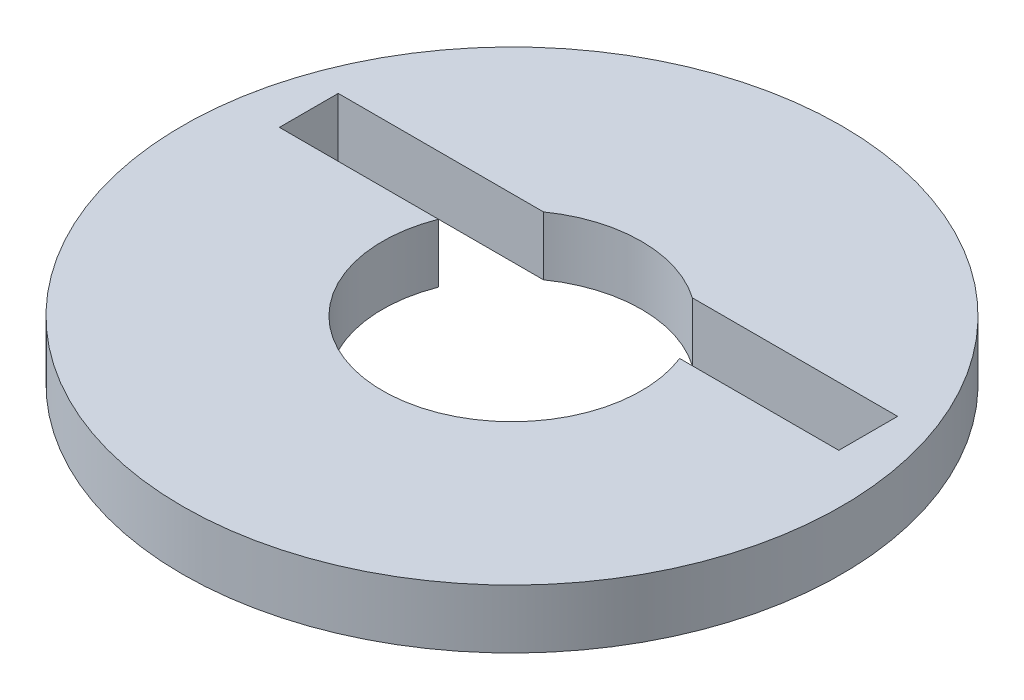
ISO-10303-21;
HEADER;
FILE_DESCRIPTION(('STEP AP214'),'2;1');
FILE_NAME('part.step','',(''),(''),'','','');
FILE_SCHEMA(('AUTOMOTIVE_DESIGN { 1 0 10303 214 1 1 1 1 }'));
ENDSEC;
DATA;
#1=APPLICATION_CONTEXT('core data for automotive mechanical design processes');
#2=APPLICATION_PROTOCOL_DEFINITION('international standard','automotive_design',2000,#1);
#3=PRODUCT_CONTEXT('',#1,'mechanical');
#4=PRODUCT('Part','Part','',(#3));
#5=PRODUCT_RELATED_PRODUCT_CATEGORY('part','',(#4));
#6=PRODUCT_DEFINITION_FORMATION('','',#4);
#7=PRODUCT_DEFINITION_CONTEXT('part definition',#1,'design');
#8=PRODUCT_DEFINITION('design','',#6,#7);
#9=PRODUCT_DEFINITION_SHAPE('','',#8);
#10=(LENGTH_UNIT() NAMED_UNIT(*) SI_UNIT(.MILLI.,.METRE.));
#11=(NAMED_UNIT(*) PLANE_ANGLE_UNIT() SI_UNIT($,.RADIAN.));
#12=(NAMED_UNIT(*) SI_UNIT($,.STERADIAN.) SOLID_ANGLE_UNIT());
#13=UNCERTAINTY_MEASURE_WITH_UNIT(LENGTH_MEASURE(1.E-05),#10,'distance_accuracy_value','');
#14=(GEOMETRIC_REPRESENTATION_CONTEXT(3) GLOBAL_UNCERTAINTY_ASSIGNED_CONTEXT((#13)) GLOBAL_UNIT_ASSIGNED_CONTEXT((#10,
#11,#12)) REPRESENTATION_CONTEXT('',''));
#15=CARTESIAN_POINT('',(0.,0.,0.));
#16=DIRECTION('',(0.,0.,1.));
#17=DIRECTION('',(1.,0.,0.));
#18=AXIS2_PLACEMENT_3D('',#15,#16,#17);
#19=CARTESIAN_POINT('',(-15.0899035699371,0.,-2.54));
#20=DIRECTION('',(0.,0.,1.));
#21=DIRECTION('',(1.,0.,0.));
#22=AXIS2_PLACEMENT_3D('',#19,#20,#21);
#23=PLANE('',#22);
#24=DIRECTION('',(1.,0.,0.));
#25=VECTOR('',#24,1.);
#26=CARTESIAN_POINT('',(-15.0899035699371,0.,-2.54));
#27=LINE('',#26,#25);
#28=CARTESIAN_POINT('',(6.50681373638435,0.,-2.54));
#29=VERTEX_POINT('',#28);
#30=CARTESIAN_POINT('',(15.0899035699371,0.,-2.54));
#31=VERTEX_POINT('',#30);
#32=EDGE_CURVE('E119',#29,#31,#27,.T.);
#33=ORIENTED_EDGE('',*,*,#32,.F.);
#34=DIRECTION('',(0.,1.,0.));
#35=VECTOR('',#34,1.);
#36=CARTESIAN_POINT('',(6.50681373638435,0.,-2.54));
#37=LINE('',#36,#35);
#38=CARTESIAN_POINT('',(6.50681373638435,3.175,-2.54));
#39=VERTEX_POINT('',#38);
#40=EDGE_CURVE('E106',#29,#39,#37,.T.);
#41=ORIENTED_EDGE('',*,*,#40,.T.);
#42=DIRECTION('',(1.,0.,0.));
#43=VECTOR('',#42,1.);
#44=CARTESIAN_POINT('',(-15.0899035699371,3.175,-2.54));
#45=LINE('',#44,#43);
#46=CARTESIAN_POINT('',(15.0899035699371,3.175,-2.54));
#47=VERTEX_POINT('',#46);
#48=EDGE_CURVE('E117',#39,#47,#45,.T.);
#49=ORIENTED_EDGE('',*,*,#48,.T.);
#50=DIRECTION('',(0.,1.,0.));
#51=VECTOR('',#50,1.);
#52=CARTESIAN_POINT('',(15.0899035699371,0.,-2.54));
#53=LINE('',#52,#51);
#54=EDGE_CURVE('E136',#31,#47,#53,.T.);
#55=ORIENTED_EDGE('',*,*,#54,.F.);
#56=EDGE_LOOP('',(#33,#41,#49,#55));
#57=FACE_BOUND('',#56,.T.);
#58=ADVANCED_FACE('F40',(#57),#23,.F.);
#59=CARTESIAN_POINT('',(-15.0899035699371,0.,-5.715));
#60=DIRECTION('',(0.,0.,-1.));
#61=DIRECTION('',(-1.,0.,0.));
#62=AXIS2_PLACEMENT_3D('',#59,#60,#61);
#63=PLANE('',#62);
#64=DIRECTION('',(-1.,0.,0.));
#65=VECTOR('',#64,1.);
#66=CARTESIAN_POINT('',(-15.0899035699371,0.,-5.715));
#67=LINE('',#66,#65);
#68=CARTESIAN_POINT('',(-4.01609262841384,0.,-5.715));
#69=VERTEX_POINT('',#68);
#70=CARTESIAN_POINT('',(-15.0899035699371,0.,-5.715));
#71=VERTEX_POINT('',#70);
#72=EDGE_CURVE('E165',#69,#71,#67,.T.);
#73=ORIENTED_EDGE('',*,*,#72,.F.);
#74=DIRECTION('',(0.,1.,0.));
#75=VECTOR('',#74,1.);
#76=CARTESIAN_POINT('',(-4.01609262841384,0.,-5.715));
#77=LINE('',#76,#75);
#78=CARTESIAN_POINT('',(-4.01609262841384,3.175,-5.715));
#79=VERTEX_POINT('',#78);
#80=EDGE_CURVE('E11',#69,#79,#77,.T.);
#81=ORIENTED_EDGE('',*,*,#80,.T.);
#82=DIRECTION('',(-1.,0.,0.));
#83=VECTOR('',#82,1.);
#84=CARTESIAN_POINT('',(-15.0899035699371,3.175,-5.715));
#85=LINE('',#84,#83);
#86=CARTESIAN_POINT('',(-15.0899035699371,3.175,-5.715));
#87=VERTEX_POINT('',#86);
#88=EDGE_CURVE('E173',#79,#87,#85,.T.);
#89=ORIENTED_EDGE('',*,*,#88,.T.);
#90=DIRECTION('',(0.,1.,0.));
#91=VECTOR('',#90,1.);
#92=CARTESIAN_POINT('',(-15.0899035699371,0.,-5.715));
#93=LINE('',#92,#91);
#94=EDGE_CURVE('E141',#71,#87,#93,.T.);
#95=ORIENTED_EDGE('',*,*,#94,.F.);
#96=EDGE_LOOP('',(#73,#81,#89,#95));
#97=FACE_BOUND('',#96,.T.);
#98=ADVANCED_FACE('F177',(#97),#63,.F.);
#99=CARTESIAN_POINT('',(0.,3.175,0.));
#100=DIRECTION('',(0.,-1.,0.));
#101=DIRECTION('',(0.,0.,-1.));
#102=AXIS2_PLACEMENT_3D('',#99,#100,#101);
#103=CYLINDRICAL_SURFACE('',#102,17.78);
#104=CARTESIAN_POINT('',(0.,3.175,0.));
#105=DIRECTION('',(0.,1.,0.));
#106=DIRECTION('',(0.,0.,1.));
#107=AXIS2_PLACEMENT_3D('',#104,#105,#106);
#108=CIRCLE('',#107,17.78);
#109=CARTESIAN_POINT('',(0.,3.175,17.78));
#110=VERTEX_POINT('',#109);
#111=EDGE_CURVE('E148',#110,#110,#108,.T.);
#112=ORIENTED_EDGE('',*,*,#111,.F.);
#113=EDGE_LOOP('',(#112));
#114=FACE_BOUND('',#113,.T.);
#115=CARTESIAN_POINT('',(0.,0.,0.));
#116=DIRECTION('',(0.,1.,0.));
#117=DIRECTION('',(0.,0.,1.));
#118=AXIS2_PLACEMENT_3D('',#115,#116,#117);
#119=CIRCLE('',#118,17.78);
#120=CARTESIAN_POINT('',(0.,0.,17.78));
#121=VERTEX_POINT('',#120);
#122=EDGE_CURVE('E138',#121,#121,#119,.T.);
#123=ORIENTED_EDGE('',*,*,#122,.T.);
#124=EDGE_LOOP('',(#123));
#125=FACE_BOUND('',#124,.T.);
#126=ADVANCED_FACE('F42',(#114,#125),#103,.T.);
#127=CARTESIAN_POINT('',(0.,3.175,0.));
#128=DIRECTION('',(0.,1.,0.));
#129=DIRECTION('',(0.,0.,1.));
#130=AXIS2_PLACEMENT_3D('',#127,#128,#129);
#131=PLANE('',#130);
#132=CARTESIAN_POINT('',(0.,3.175,0.));
#133=DIRECTION('',(0.,1.,0.));
#134=DIRECTION('',(0.,0.,1.));
#135=AXIS2_PLACEMENT_3D('',#132,#133,#134);
#136=CIRCLE('',#135,6.985);
#137=CARTESIAN_POINT('',(4.01609262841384,3.175,-5.715));
#138=VERTEX_POINT('',#137);
#139=EDGE_CURVE('E112',#138,#79,#136,.T.);
#140=ORIENTED_EDGE('',*,*,#139,.F.);
#141=CARTESIAN_POINT('',(15.0899035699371,3.175,-5.715));
#142=VERTEX_POINT('',#141);
#143=EDGE_CURVE('E132',#142,#138,#85,.T.);
#144=ORIENTED_EDGE('',*,*,#143,.F.);
#145=DIRECTION('',(0.,0.,-1.));
#146=VECTOR('',#145,1.);
#147=CARTESIAN_POINT('',(15.0899035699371,3.175,-2.54));
#148=LINE('',#147,#146);
#149=EDGE_CURVE('E120',#47,#142,#148,.T.);
#150=ORIENTED_EDGE('',*,*,#149,.F.);
#151=ORIENTED_EDGE('',*,*,#48,.F.);
#152=CARTESIAN_POINT('',(-6.50681373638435,3.175,-2.54));
#153=VERTEX_POINT('',#152);
#154=EDGE_CURVE('E103',#153,#39,#136,.T.);
#155=ORIENTED_EDGE('',*,*,#154,.F.);
#156=CARTESIAN_POINT('',(-15.0899035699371,3.175,-2.54));
#157=VERTEX_POINT('',#156);
#158=EDGE_CURVE('E127',#157,#153,#45,.T.);
#159=ORIENTED_EDGE('',*,*,#158,.F.);
#160=DIRECTION('',(0.,0.,1.));
#161=VECTOR('',#160,1.);
#162=CARTESIAN_POINT('',(-15.0899035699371,3.175,-2.54));
#163=LINE('',#162,#161);
#164=EDGE_CURVE('E128',#87,#157,#163,.T.);
#165=ORIENTED_EDGE('',*,*,#164,.F.);
#166=ORIENTED_EDGE('',*,*,#88,.F.);
#167=EDGE_LOOP('',(#140,#144,#150,#151,#155,#159,#165,#166));
#168=FACE_BOUND('',#167,.T.);
#169=ORIENTED_EDGE('',*,*,#111,.T.);
#170=EDGE_LOOP('',(#169));
#171=FACE_BOUND('',#170,.T.);
#172=ADVANCED_FACE('F124',(#168,#171),#131,.T.);
#173=CARTESIAN_POINT('',(0.,0.,0.));
#174=DIRECTION('',(0.,1.,0.));
#175=DIRECTION('',(0.,0.,1.));
#176=AXIS2_PLACEMENT_3D('',#173,#174,#175);
#177=PLANE('',#176);
#178=CARTESIAN_POINT('',(15.0899035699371,0.,-5.715));
#179=VERTEX_POINT('',#178);
#180=CARTESIAN_POINT('',(4.01609262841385,0.,-5.715));
#181=VERTEX_POINT('',#180);
#182=EDGE_CURVE('E157',#179,#181,#67,.T.);
#183=ORIENTED_EDGE('',*,*,#182,.T.);
#184=CARTESIAN_POINT('',(0.,0.,0.));
#185=DIRECTION('',(0.,1.,0.));
#186=DIRECTION('',(0.,0.,1.));
#187=AXIS2_PLACEMENT_3D('',#184,#185,#186);
#188=CIRCLE('',#187,6.985);
#189=EDGE_CURVE('E63',#181,#69,#188,.T.);
#190=ORIENTED_EDGE('',*,*,#189,.T.);
#191=ORIENTED_EDGE('',*,*,#72,.T.);
#192=DIRECTION('',(0.,0.,1.));
#193=VECTOR('',#192,1.);
#194=CARTESIAN_POINT('',(-15.0899035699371,0.,-2.54));
#195=LINE('',#194,#193);
#196=CARTESIAN_POINT('',(-15.0899035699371,0.,-2.54));
#197=VERTEX_POINT('',#196);
#198=EDGE_CURVE('E164',#71,#197,#195,.T.);
#199=ORIENTED_EDGE('',*,*,#198,.T.);
#200=CARTESIAN_POINT('',(-6.50681373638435,0.,-2.54));
#201=VERTEX_POINT('',#200);
#202=EDGE_CURVE('E147',#197,#201,#27,.T.);
#203=ORIENTED_EDGE('',*,*,#202,.T.);
#204=EDGE_CURVE('E55',#201,#29,#188,.T.);
#205=ORIENTED_EDGE('',*,*,#204,.T.);
#206=ORIENTED_EDGE('',*,*,#32,.T.);
#207=DIRECTION('',(0.,0.,-1.));
#208=VECTOR('',#207,1.);
#209=CARTESIAN_POINT('',(15.0899035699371,0.,-2.54));
#210=LINE('',#209,#208);
#211=EDGE_CURVE('E130',#31,#179,#210,.T.);
#212=ORIENTED_EDGE('',*,*,#211,.T.);
#213=EDGE_LOOP('',(#183,#190,#191,#199,#203,#205,#206,#212));
#214=FACE_BOUND('',#213,.T.);
#215=ORIENTED_EDGE('',*,*,#122,.F.);
#216=EDGE_LOOP('',(#215));
#217=FACE_BOUND('',#216,.T.);
#218=ADVANCED_FACE('F160',(#214,#217),#177,.F.);
#219=CARTESIAN_POINT('',(15.0899035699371,0.,-2.54));
#220=DIRECTION('',(1.,0.,0.));
#221=DIRECTION('',(0.,0.,-1.));
#222=AXIS2_PLACEMENT_3D('',#219,#220,#221);
#223=PLANE('',#222);
#224=ORIENTED_EDGE('',*,*,#149,.T.);
#225=DIRECTION('',(0.,1.,0.));
#226=VECTOR('',#225,1.);
#227=CARTESIAN_POINT('',(15.0899035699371,0.,-5.715));
#228=LINE('',#227,#226);
#229=EDGE_CURVE('E144',#179,#142,#228,.T.);
#230=ORIENTED_EDGE('',*,*,#229,.F.);
#231=ORIENTED_EDGE('',*,*,#211,.F.);
#232=ORIENTED_EDGE('',*,*,#54,.T.);
#233=EDGE_LOOP('',(#224,#230,#231,#232));
#234=FACE_BOUND('',#233,.T.);
#235=ADVANCED_FACE('F202',(#234),#223,.F.);
#236=ORIENTED_EDGE('',*,*,#158,.T.);
#237=DIRECTION('',(0.,1.,0.));
#238=VECTOR('',#237,1.);
#239=CARTESIAN_POINT('',(-6.50681373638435,0.,-2.54));
#240=LINE('',#239,#238);
#241=EDGE_CURVE('E107',#153,#201,#240,.F.);
#242=ORIENTED_EDGE('',*,*,#241,.T.);
#243=ORIENTED_EDGE('',*,*,#202,.F.);
#244=DIRECTION('',(0.,1.,0.));
#245=VECTOR('',#244,1.);
#246=CARTESIAN_POINT('',(-15.0899035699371,0.,-2.54));
#247=LINE('',#246,#245);
#248=EDGE_CURVE('E139',#197,#157,#247,.T.);
#249=ORIENTED_EDGE('',*,*,#248,.T.);
#250=EDGE_LOOP('',(#236,#242,#243,#249));
#251=FACE_BOUND('',#250,.T.);
#252=ADVANCED_FACE('F183',(#251),#23,.F.);
#253=CARTESIAN_POINT('',(-15.0899035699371,0.,-2.54));
#254=DIRECTION('',(-1.,0.,0.));
#255=DIRECTION('',(0.,0.,1.));
#256=AXIS2_PLACEMENT_3D('',#253,#254,#255);
#257=PLANE('',#256);
#258=ORIENTED_EDGE('',*,*,#164,.T.);
#259=ORIENTED_EDGE('',*,*,#248,.F.);
#260=ORIENTED_EDGE('',*,*,#198,.F.);
#261=ORIENTED_EDGE('',*,*,#94,.T.);
#262=EDGE_LOOP('',(#258,#259,#260,#261));
#263=FACE_BOUND('',#262,.T.);
#264=ADVANCED_FACE('F181',(#263),#257,.F.);
#265=ORIENTED_EDGE('',*,*,#143,.T.);
#266=DIRECTION('',(0.,1.,0.));
#267=VECTOR('',#266,1.);
#268=CARTESIAN_POINT('',(4.01609262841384,0.,-5.715));
#269=LINE('',#268,#267);
#270=EDGE_CURVE('E48',#138,#181,#269,.F.);
#271=ORIENTED_EDGE('',*,*,#270,.T.);
#272=ORIENTED_EDGE('',*,*,#182,.F.);
#273=ORIENTED_EDGE('',*,*,#229,.T.);
#274=EDGE_LOOP('',(#265,#271,#272,#273));
#275=FACE_BOUND('',#274,.T.);
#276=ADVANCED_FACE('F156',(#275),#63,.F.);
#277=CARTESIAN_POINT('',(0.,0.,0.));
#278=DIRECTION('',(0.,1.,0.));
#279=DIRECTION('',(0.,0.,1.));
#280=AXIS2_PLACEMENT_3D('',#277,#278,#279);
#281=CYLINDRICAL_SURFACE('',#280,6.985);
#282=ORIENTED_EDGE('',*,*,#189,.F.);
#283=ORIENTED_EDGE('',*,*,#270,.F.);
#284=ORIENTED_EDGE('',*,*,#139,.T.);
#285=ORIENTED_EDGE('',*,*,#80,.F.);
#286=EDGE_LOOP('',(#282,#283,#284,#285));
#287=FACE_BOUND('',#286,.T.);
#288=ADVANCED_FACE('F187',(#287),#281,.F.);
#289=ORIENTED_EDGE('',*,*,#204,.F.);
#290=ORIENTED_EDGE('',*,*,#241,.F.);
#291=ORIENTED_EDGE('',*,*,#154,.T.);
#292=ORIENTED_EDGE('',*,*,#40,.F.);
#293=EDGE_LOOP('',(#289,#290,#291,#292));
#294=FACE_BOUND('',#293,.T.);
#295=ADVANCED_FACE('F105',(#294),#281,.F.);
#296=CLOSED_SHELL('',(#58,#98,#126,#172,#218,#235,#252,#264,#276,#288,#295));
#297=MANIFOLD_SOLID_BREP('B2',#296);
#298=ADVANCED_BREP_SHAPE_REPRESENTATION('',(#18,#297),#14);
#299=SHAPE_DEFINITION_REPRESENTATION(#9,#298);
ENDSEC;
END-ISO-10303-21;
